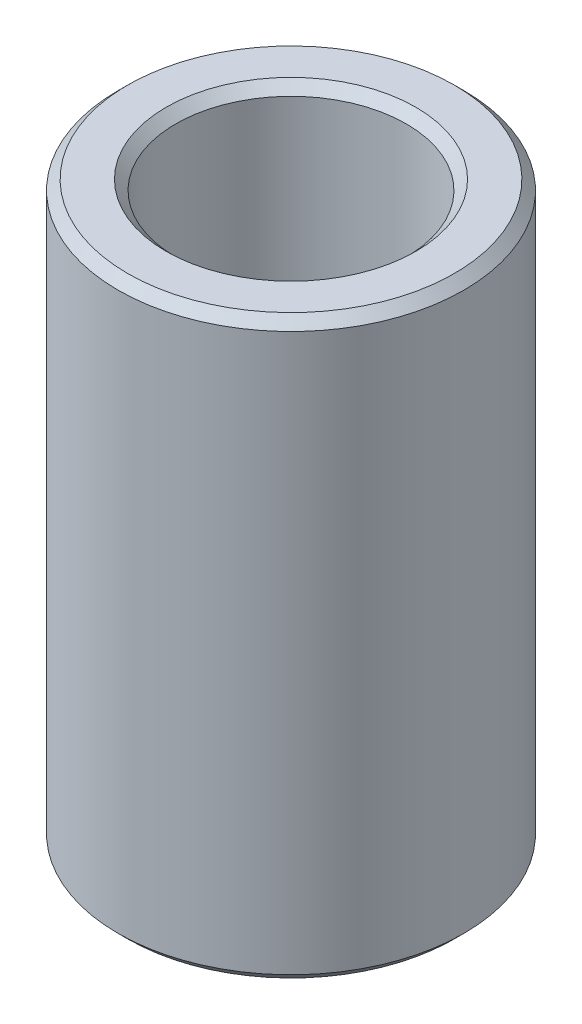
from build123d import *

# Parameters (mm, degrees)
SKETCH1_R          = 4.5
EXTRUDE1_DEPTH     = 15
SKETCH2_R          = 3
CUT_EXTRUDE1_DEPTH = 15
CHAMFER1_SIZE      = 0.25


with BuildPart() as part:
    # Sketch1 → Extrude1 (new body)
    with BuildSketch(Plane(origin=(0, 0, 0), x_dir=(1, 0, 0), z_dir=(0, 1, 0))):
        with Locations(Location((0, 0, 0), (0, 0, 270))):
            Circle(SKETCH1_R)
    extrude(amount=EXTRUDE1_DEPTH)

    # Sketch2 → Cut-Extrude1 (cut)
    with BuildSketch(Plane(origin=(0, 15, 0), x_dir=(-1, 0, 0), z_dir=(0, 1, 0))):
        with Locations(Location((0, 0, 0), (0, 0, 90))):
            Circle(SKETCH2_R)
    extrude(amount=-CUT_EXTRUDE1_DEPTH, mode=Mode.SUBTRACT)

    # Chamfer1
    chamfer1_edges = [part.edges().sort_by_distance(p)[0] for p in [
        (0, 0, -4.5),
        (0, 15, -4.5),
        (0, 0, -3),
        (0, 15, -3),
    ]]
    chamfer(chamfer1_edges, length=CHAMFER1_SIZE)


solid = part.part
